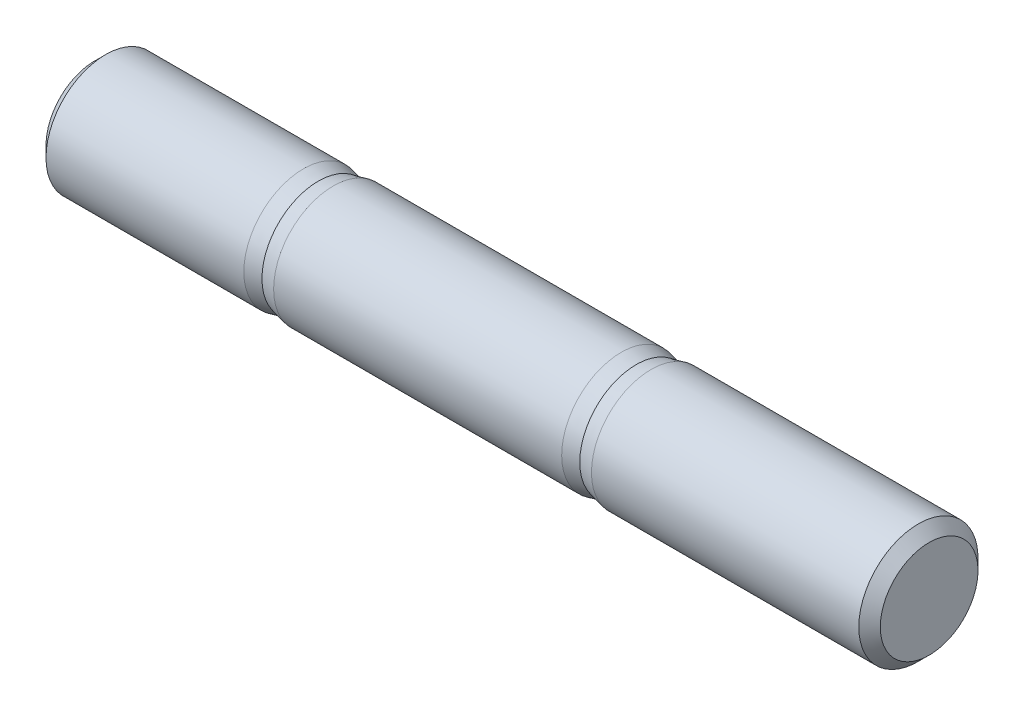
ISO-10303-21;
HEADER;
FILE_DESCRIPTION(('STEP AP214'),'2;1');
FILE_NAME('part.step','',(''),(''),'','','');
FILE_SCHEMA(('AUTOMOTIVE_DESIGN { 1 0 10303 214 1 1 1 1 }'));
ENDSEC;
DATA;
#1=APPLICATION_CONTEXT('core data for automotive mechanical design processes');
#2=APPLICATION_PROTOCOL_DEFINITION('international standard','automotive_design',2000,#1);
#3=PRODUCT_CONTEXT('',#1,'mechanical');
#4=PRODUCT('Part','Part','',(#3));
#5=PRODUCT_RELATED_PRODUCT_CATEGORY('part','',(#4));
#6=PRODUCT_DEFINITION_FORMATION('','',#4);
#7=PRODUCT_DEFINITION_CONTEXT('part definition',#1,'design');
#8=PRODUCT_DEFINITION('design','',#6,#7);
#9=PRODUCT_DEFINITION_SHAPE('','',#8);
#10=(LENGTH_UNIT() NAMED_UNIT(*) SI_UNIT(.MILLI.,.METRE.));
#11=(NAMED_UNIT(*) PLANE_ANGLE_UNIT() SI_UNIT($,.RADIAN.));
#12=(NAMED_UNIT(*) SI_UNIT($,.STERADIAN.) SOLID_ANGLE_UNIT());
#13=UNCERTAINTY_MEASURE_WITH_UNIT(LENGTH_MEASURE(1.E-05),#10,'distance_accuracy_value','');
#14=(GEOMETRIC_REPRESENTATION_CONTEXT(3) GLOBAL_UNCERTAINTY_ASSIGNED_CONTEXT((#13)) GLOBAL_UNIT_ASSIGNED_CONTEXT((#10,
#11,#12)) REPRESENTATION_CONTEXT('',''));
#15=CARTESIAN_POINT('',(0.,0.,0.));
#16=DIRECTION('',(0.,0.,1.));
#17=DIRECTION('',(1.,0.,0.));
#18=AXIS2_PLACEMENT_3D('',#15,#16,#17);
#19=CARTESIAN_POINT('',(12.,0.,0.));
#20=DIRECTION('',(-1.,0.,0.));
#21=DIRECTION('',(0.,0.,1.));
#22=AXIS2_PLACEMENT_3D('',#19,#20,#21);
#23=CONICAL_SURFACE('',#22,2.675,0.213368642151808);
#24=CARTESIAN_POINT('',(10.5,0.,0.));
#25=DIRECTION('',(-1.,0.,0.));
#26=DIRECTION('',(0.,0.,1.));
#27=AXIS2_PLACEMENT_3D('',#24,#25,#26);
#28=CIRCLE('',#27,3.);
#29=CARTESIAN_POINT('',(10.5,0.,3.));
#30=VERTEX_POINT('',#29);
#31=EDGE_CURVE('E59',#30,#30,#28,.T.);
#32=ORIENTED_EDGE('',*,*,#31,.F.);
#33=EDGE_LOOP('',(#32));
#34=FACE_BOUND('',#33,.T.);
#35=CARTESIAN_POINT('',(11.25,0.,0.));
#36=DIRECTION('',(1.,0.,0.));
#37=DIRECTION('',(0.,0.,-1.));
#38=AXIS2_PLACEMENT_3D('',#35,#36,#37);
#39=CIRCLE('',#38,2.8375);
#40=CARTESIAN_POINT('',(11.25,0.,-2.8375));
#41=VERTEX_POINT('',#40);
#42=EDGE_CURVE('E10',#41,#41,#39,.T.);
#43=ORIENTED_EDGE('',*,*,#42,.F.);
#44=EDGE_LOOP('',(#43));
#45=FACE_BOUND('',#44,.T.);
#46=ADVANCED_FACE('F33',(#34,#45),#23,.T.);
#47=CARTESIAN_POINT('',(0.,0.,0.));
#48=DIRECTION('',(1.,0.,0.));
#49=DIRECTION('',(0.,0.,-1.));
#50=AXIS2_PLACEMENT_3D('',#47,#48,#49);
#51=PLANE('',#50);
#52=CARTESIAN_POINT('',(0.,0.,0.));
#53=DIRECTION('',(1.,0.,0.));
#54=DIRECTION('',(0.,0.,-1.));
#55=AXIS2_PLACEMENT_3D('',#52,#53,#54);
#56=CIRCLE('',#55,2.4585);
#57=CARTESIAN_POINT('',(0.,0.,-2.4585));
#58=VERTEX_POINT('',#57);
#59=EDGE_CURVE('E48',#58,#58,#56,.F.);
#60=ORIENTED_EDGE('',*,*,#59,.T.);
#61=EDGE_LOOP('',(#60));
#62=FACE_BOUND('',#61,.T.);
#63=ADVANCED_FACE('F88',(#62),#51,.F.);
#64=CARTESIAN_POINT('',(-1.31084166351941,0.,0.));
#65=DIRECTION('',(-1.,0.,0.));
#66=DIRECTION('',(0.,0.,1.));
#67=AXIS2_PLACEMENT_3D('',#64,#65,#66);
#68=CYLINDRICAL_SURFACE('',#67,3.);
#69=CARTESIAN_POINT('',(0.541499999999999,0.,0.));
#70=DIRECTION('',(1.,0.,0.));
#71=DIRECTION('',(0.,0.,-1.));
#72=AXIS2_PLACEMENT_3D('',#69,#70,#71);
#73=CIRCLE('',#72,3.);
#74=CARTESIAN_POINT('',(0.541499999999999,0.,-3.));
#75=VERTEX_POINT('',#74);
#76=EDGE_CURVE('E44',#75,#75,#73,.T.);
#77=ORIENTED_EDGE('',*,*,#76,.T.);
#78=EDGE_LOOP('',(#77));
#79=FACE_BOUND('',#78,.T.);
#80=ORIENTED_EDGE('',*,*,#31,.T.);
#81=EDGE_LOOP('',(#80));
#82=FACE_BOUND('',#81,.T.);
#83=ADVANCED_FACE('F94',(#79,#82),#68,.T.);
#84=CARTESIAN_POINT('',(0.,0.,0.));
#85=DIRECTION('',(1.,0.,0.));
#86=DIRECTION('',(0.,0.,-1.));
#87=AXIS2_PLACEMENT_3D('',#84,#85,#86);
#88=CONICAL_SURFACE('',#87,2.4585,0.78539816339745);
#89=ORIENTED_EDGE('',*,*,#76,.F.);
#90=EDGE_LOOP('',(#89));
#91=FACE_BOUND('',#90,.T.);
#92=ORIENTED_EDGE('',*,*,#59,.F.);
#93=EDGE_LOOP('',(#92));
#94=FACE_BOUND('',#93,.T.);
#95=ADVANCED_FACE('F35',(#91,#94),#88,.T.);
#96=CARTESIAN_POINT('',(12.,0.,0.));
#97=DIRECTION('',(1.,0.,0.));
#98=DIRECTION('',(0.,0.,-1.));
#99=AXIS2_PLACEMENT_3D('',#96,#97,#98);
#100=CONICAL_SURFACE('',#99,3.,0.213368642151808);
#101=CARTESIAN_POINT('',(12.,0.,0.));
#102=DIRECTION('',(-1.,0.,0.));
#103=DIRECTION('',(0.,0.,1.));
#104=AXIS2_PLACEMENT_3D('',#101,#102,#103);
#105=CIRCLE('',#104,3.);
#106=CARTESIAN_POINT('',(12.,0.,3.));
#107=VERTEX_POINT('',#106);
#108=EDGE_CURVE('E65',#107,#107,#105,.T.);
#109=ORIENTED_EDGE('',*,*,#108,.T.);
#110=EDGE_LOOP('',(#109));
#111=FACE_BOUND('',#110,.T.);
#112=ORIENTED_EDGE('',*,*,#42,.T.);
#113=EDGE_LOOP('',(#112));
#114=FACE_BOUND('',#113,.T.);
#115=ADVANCED_FACE('F76',(#111,#114),#100,.T.);
#116=CARTESIAN_POINT('',(28.,0.,0.));
#117=DIRECTION('',(-1.,0.,0.));
#118=DIRECTION('',(0.,0.,1.));
#119=AXIS2_PLACEMENT_3D('',#116,#117,#118);
#120=CONICAL_SURFACE('',#119,2.675,0.213368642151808);
#121=CARTESIAN_POINT('',(26.5,0.,0.));
#122=DIRECTION('',(-1.,0.,0.));
#123=DIRECTION('',(0.,0.,1.));
#124=AXIS2_PLACEMENT_3D('',#121,#122,#123);
#125=CIRCLE('',#124,3.);
#126=CARTESIAN_POINT('',(26.5,0.,3.));
#127=VERTEX_POINT('',#126);
#128=EDGE_CURVE('E68',#127,#127,#125,.T.);
#129=ORIENTED_EDGE('',*,*,#128,.F.);
#130=EDGE_LOOP('',(#129));
#131=FACE_BOUND('',#130,.T.);
#132=CARTESIAN_POINT('',(27.25,0.,0.));
#133=DIRECTION('',(-1.,0.,0.));
#134=DIRECTION('',(0.,0.,1.));
#135=AXIS2_PLACEMENT_3D('',#132,#133,#134);
#136=CIRCLE('',#135,2.8375);
#137=CARTESIAN_POINT('',(27.25,0.,2.8375));
#138=VERTEX_POINT('',#137);
#139=EDGE_CURVE('E40',#138,#138,#136,.T.);
#140=ORIENTED_EDGE('',*,*,#139,.T.);
#141=EDGE_LOOP('',(#140));
#142=FACE_BOUND('',#141,.T.);
#143=ADVANCED_FACE('F74',(#131,#142),#120,.T.);
#144=CARTESIAN_POINT('',(-1.31084166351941,0.,0.));
#145=DIRECTION('',(-1.,0.,0.));
#146=DIRECTION('',(0.,0.,1.));
#147=AXIS2_PLACEMENT_3D('',#144,#145,#146);
#148=CYLINDRICAL_SURFACE('',#147,3.);
#149=ORIENTED_EDGE('',*,*,#108,.F.);
#150=EDGE_LOOP('',(#149));
#151=FACE_BOUND('',#150,.T.);
#152=ORIENTED_EDGE('',*,*,#128,.T.);
#153=EDGE_LOOP('',(#152));
#154=FACE_BOUND('',#153,.T.);
#155=ADVANCED_FACE('F72',(#151,#154),#148,.T.);
#156=CARTESIAN_POINT('',(42.,3.,0.));
#157=DIRECTION('',(-1.,0.,0.));
#158=DIRECTION('',(0.,0.,1.));
#159=AXIS2_PLACEMENT_3D('',#156,#157,#158);
#160=PLANE('',#159);
#161=CARTESIAN_POINT('',(42.,0.,0.));
#162=DIRECTION('',(-1.,0.,0.));
#163=DIRECTION('',(0.,0.,1.));
#164=AXIS2_PLACEMENT_3D('',#161,#162,#163);
#165=CIRCLE('',#164,2.45850000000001);
#166=CARTESIAN_POINT('',(42.,0.,2.45850000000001));
#167=VERTEX_POINT('',#166);
#168=EDGE_CURVE('E53',#167,#167,#165,.F.);
#169=ORIENTED_EDGE('',*,*,#168,.T.);
#170=EDGE_LOOP('',(#169));
#171=FACE_BOUND('',#170,.T.);
#172=ADVANCED_FACE('F82',(#171),#160,.F.);
#173=CARTESIAN_POINT('',(41.4585,0.,0.));
#174=DIRECTION('',(-1.,0.,0.));
#175=DIRECTION('',(0.,0.,1.));
#176=AXIS2_PLACEMENT_3D('',#173,#174,#175);
#177=CONICAL_SURFACE('',#176,3.,0.78539816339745);
#178=ORIENTED_EDGE('',*,*,#168,.F.);
#179=EDGE_LOOP('',(#178));
#180=FACE_BOUND('',#179,.T.);
#181=CARTESIAN_POINT('',(41.4585,0.,0.));
#182=DIRECTION('',(-1.,0.,0.));
#183=DIRECTION('',(0.,0.,1.));
#184=AXIS2_PLACEMENT_3D('',#181,#182,#183);
#185=CIRCLE('',#184,3.);
#186=CARTESIAN_POINT('',(41.4585,0.,3.));
#187=VERTEX_POINT('',#186);
#188=EDGE_CURVE('E56',#187,#187,#185,.T.);
#189=ORIENTED_EDGE('',*,*,#188,.F.);
#190=EDGE_LOOP('',(#189));
#191=FACE_BOUND('',#190,.T.);
#192=ADVANCED_FACE('F105',(#180,#191),#177,.T.);
#193=CARTESIAN_POINT('',(-1.31084166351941,0.,0.));
#194=DIRECTION('',(-1.,0.,0.));
#195=DIRECTION('',(0.,0.,1.));
#196=AXIS2_PLACEMENT_3D('',#193,#194,#195);
#197=CYLINDRICAL_SURFACE('',#196,3.);
#198=ORIENTED_EDGE('',*,*,#188,.T.);
#199=EDGE_LOOP('',(#198));
#200=FACE_BOUND('',#199,.T.);
#201=CARTESIAN_POINT('',(28.,0.,0.));
#202=DIRECTION('',(-1.,0.,0.));
#203=DIRECTION('',(0.,0.,1.));
#204=AXIS2_PLACEMENT_3D('',#201,#202,#203);
#205=CIRCLE('',#204,3.);
#206=CARTESIAN_POINT('',(28.,0.,3.));
#207=VERTEX_POINT('',#206);
#208=EDGE_CURVE('E62',#207,#207,#205,.T.);
#209=ORIENTED_EDGE('',*,*,#208,.F.);
#210=EDGE_LOOP('',(#209));
#211=FACE_BOUND('',#210,.T.);
#212=ADVANCED_FACE('F107',(#200,#211),#197,.T.);
#213=CARTESIAN_POINT('',(28.,0.,0.));
#214=DIRECTION('',(1.,0.,0.));
#215=DIRECTION('',(0.,0.,-1.));
#216=AXIS2_PLACEMENT_3D('',#213,#214,#215);
#217=CONICAL_SURFACE('',#216,3.,0.213368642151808);
#218=ORIENTED_EDGE('',*,*,#208,.T.);
#219=EDGE_LOOP('',(#218));
#220=FACE_BOUND('',#219,.T.);
#221=ORIENTED_EDGE('',*,*,#139,.F.);
#222=EDGE_LOOP('',(#221));
#223=FACE_BOUND('',#222,.T.);
#224=ADVANCED_FACE('F101',(#220,#223),#217,.T.);
#225=CLOSED_SHELL('',(#46,#63,#83,#95,#115,#143,#155,#172,#192,#212,#224));
#226=MANIFOLD_SOLID_BREP('B2',#225);
#227=ADVANCED_BREP_SHAPE_REPRESENTATION('',(#18,#226),#14);
#228=SHAPE_DEFINITION_REPRESENTATION(#9,#227);
ENDSEC;
END-ISO-10303-21;
